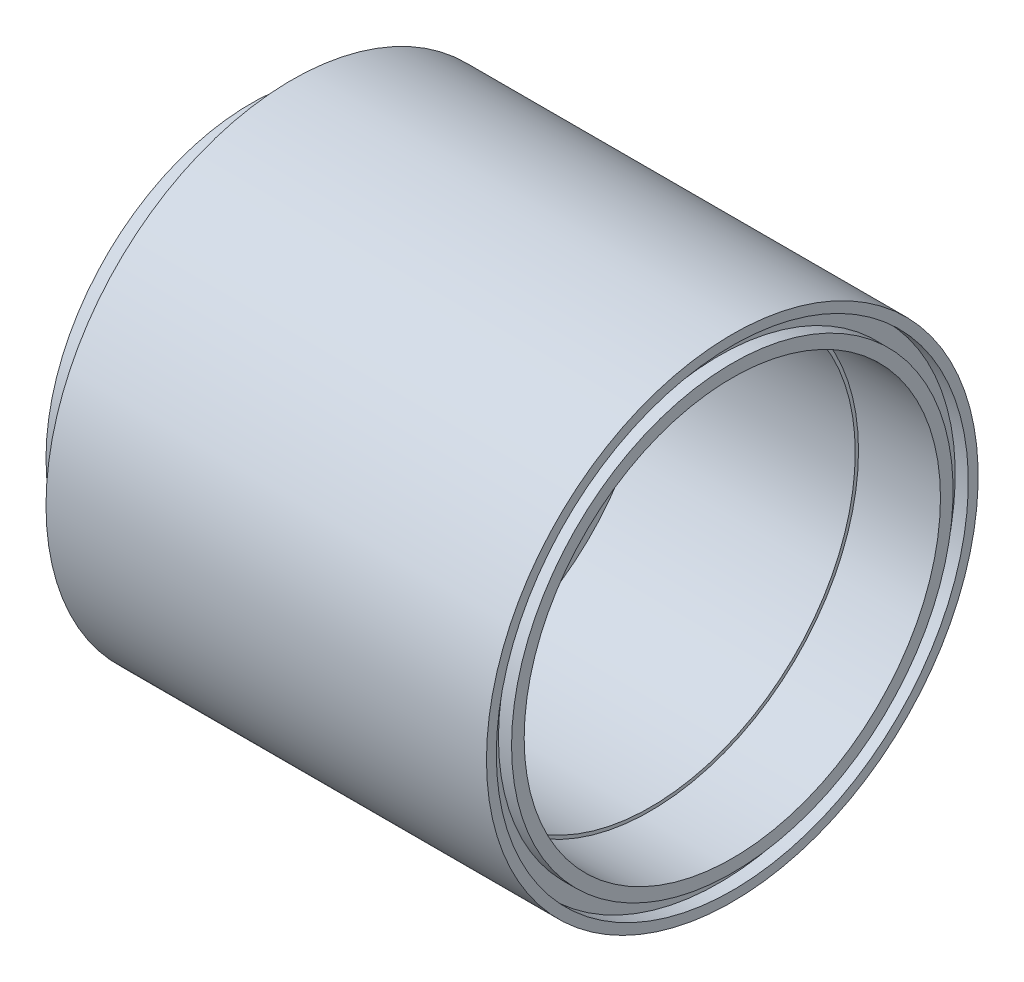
from build123d import *

# Parameters (mm, degrees)
CUT_EXTRUDE1_REACH        = 74.973
SKETCH2_R                 = 1.778
SKETCH2_R_2               = 2.54
F_2_56_TAPPED_HOLE1_D     = 1.778
F_2_56_TAPPED_HOLE1_DEPTH = 4.318


with BuildPart() as part:
    # Sketch1 → Revolve1 (revolve)
    with BuildSketch(Plane.XY, mode=Mode.PRIVATE) as revolve1_sk:
        Polygon((-6.35, 38.1), (-23.8125, 38.1), (-23.8125, 31.75), (-30.1625, 31.75), (-30.1625, 28.8925), (-11.1125, 28.8925), (-11.1125, 27.051), (-9.4615, 27.051), (-9.4615, 25.4), (-11.1125, 25.4), (-11.1125, 22.86), (-4.7625, 22.86), (-4.7625, 0), (0, 0), (0, 31.75), (-6.35, 31.75), align=None)
        Polygon((31.75, 31.75), (0, 31.75), (-6.35, 31.75), (-6.35, 38.1), (44.45, 38.1), (44.45, 36.576), (42.418, 36.576), (42.418, 34.2138), (44.45, 34.2138), (44.45, 32.258), (31.75, 32.258), align=None)
    revolve(revolve1_sk.sketch.rotate(Axis((-4.7625, 0, 0), (1, 0, 0)), 90), axis=Axis((-4.7625, 0, 0), (1, 0, 0)))

    # Sketch2 → Cut-Extrude1 (cut, up to next)
    with BuildSketch(Plane.ZY.offset(4.7625), mode=Mode.PRIVATE) as cut_extrude1_sk1:
        with Locations((-8.509, 0)):
            Circle(SKETCH2_R)
    cut_extrude1_tool1 = extrude(cut_extrude1_sk1.sketch, amount=-CUT_EXTRUDE1_REACH, mode=Mode.PRIVATE) & part.part
    # Sketch2 → Cut-Extrude1 (cut, up to next)
    with BuildSketch(Plane.ZY.offset(4.7625), mode=Mode.PRIVATE) as cut_extrude1_sk2:
        with Locations((8.509, 0)):
            Circle(SKETCH2_R)
    cut_extrude1_tool2 = extrude(cut_extrude1_sk2.sketch, amount=-CUT_EXTRUDE1_REACH, mode=Mode.PRIVATE) & part.part
    # Sketch2 → Cut-Extrude1 (cut, up to next)
    with BuildSketch(Plane.ZY.offset(4.7625), mode=Mode.PRIVATE) as cut_extrude1_sk3:
        with Locations((0, 6.35)):
            Circle(SKETCH2_R_2)
    cut_extrude1_tool3 = extrude(cut_extrude1_sk3.sketch, amount=-CUT_EXTRUDE1_REACH, mode=Mode.PRIVATE) & part.part
    add(cut_extrude1_tool1.solids().sort_by_distance((-4.7625, 0, -8.509))[0], mode=Mode.SUBTRACT)
    add(cut_extrude1_tool2.solids().sort_by_distance((-4.7625, 0, 8.509))[0], mode=Mode.SUBTRACT)
    add(cut_extrude1_tool3.solids().sort_by_distance((-4.7625, 6.35, 0))[0], mode=Mode.SUBTRACT)

    # 2-56 Tapped Hole1
    with Locations(Plane(origin=(0, 0, 0), x_dir=(0, 0, -1), z_dir=(1, 0, 0))):
        with Locations((0, 23.114), (23.114, 0), (0, -23.114), (-23.114, 0)):
            Hole(F_2_56_TAPPED_HOLE1_D / 2, depth=F_2_56_TAPPED_HOLE1_DEPTH)


solid = part.part
